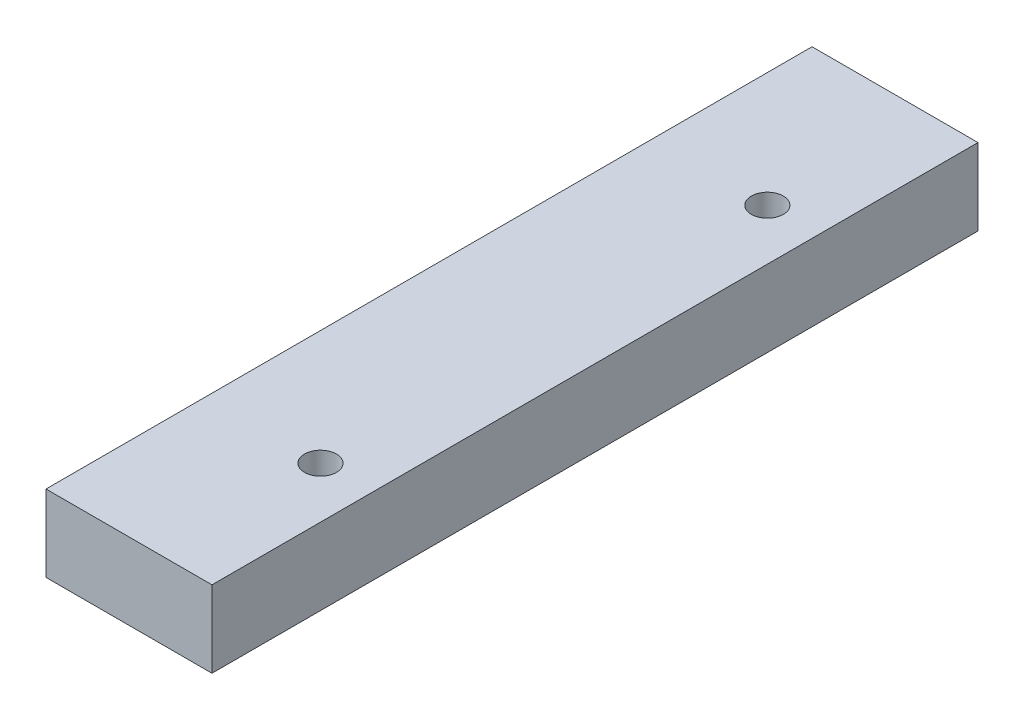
ISO-10303-21;
HEADER;
FILE_DESCRIPTION(('STEP AP214'),'2;1');
FILE_NAME('part.step','',(''),(''),'','','');
FILE_SCHEMA(('AUTOMOTIVE_DESIGN { 1 0 10303 214 1 1 1 1 }'));
ENDSEC;
DATA;
#1=APPLICATION_CONTEXT('core data for automotive mechanical design processes');
#2=APPLICATION_PROTOCOL_DEFINITION('international standard','automotive_design',2000,#1);
#3=PRODUCT_CONTEXT('',#1,'mechanical');
#4=PRODUCT('Part','Part','',(#3));
#5=PRODUCT_RELATED_PRODUCT_CATEGORY('part','',(#4));
#6=PRODUCT_DEFINITION_FORMATION('','',#4);
#7=PRODUCT_DEFINITION_CONTEXT('part definition',#1,'design');
#8=PRODUCT_DEFINITION('design','',#6,#7);
#9=PRODUCT_DEFINITION_SHAPE('','',#8);
#10=(LENGTH_UNIT() NAMED_UNIT(*) SI_UNIT(.MILLI.,.METRE.));
#11=(NAMED_UNIT(*) PLANE_ANGLE_UNIT() SI_UNIT($,.RADIAN.));
#12=(NAMED_UNIT(*) SI_UNIT($,.STERADIAN.) SOLID_ANGLE_UNIT());
#13=UNCERTAINTY_MEASURE_WITH_UNIT(LENGTH_MEASURE(1.E-05),#10,'distance_accuracy_value','');
#14=(GEOMETRIC_REPRESENTATION_CONTEXT(3) GLOBAL_UNCERTAINTY_ASSIGNED_CONTEXT((#13)) GLOBAL_UNIT_ASSIGNED_CONTEXT((#10,
#11,#12)) REPRESENTATION_CONTEXT('',''));
#15=CARTESIAN_POINT('',(0.,0.,0.));
#16=DIRECTION('',(0.,0.,1.));
#17=DIRECTION('',(1.,0.,0.));
#18=AXIS2_PLACEMENT_3D('',#15,#16,#17);
#19=CARTESIAN_POINT('',(0.,0.,60.));
#20=DIRECTION('',(1.,0.,0.));
#21=DIRECTION('',(0.,0.,-1.));
#22=AXIS2_PLACEMENT_3D('',#19,#20,#21);
#23=PLANE('',#22);
#24=DIRECTION('',(0.,-1.,0.));
#25=VECTOR('',#24,1.);
#26=CARTESIAN_POINT('',(0.,0.,-60.));
#27=LINE('',#26,#25);
#28=CARTESIAN_POINT('',(0.,12.,-60.));
#29=VERTEX_POINT('',#28);
#30=CARTESIAN_POINT('',(0.,0.,-60.));
#31=VERTEX_POINT('',#30);
#32=EDGE_CURVE('E392',#29,#31,#27,.T.);
#33=ORIENTED_EDGE('',*,*,#32,.T.);
#34=DIRECTION('',(0.,0.,-1.));
#35=VECTOR('',#34,1.);
#36=CARTESIAN_POINT('',(0.,0.,60.));
#37=LINE('',#36,#35);
#38=CARTESIAN_POINT('',(0.,0.,60.));
#39=VERTEX_POINT('',#38);
#40=EDGE_CURVE('E11',#39,#31,#37,.T.);
#41=ORIENTED_EDGE('',*,*,#40,.F.);
#42=DIRECTION('',(0.,-1.,0.));
#43=VECTOR('',#42,1.);
#44=CARTESIAN_POINT('',(0.,0.,60.));
#45=LINE('',#44,#43);
#46=CARTESIAN_POINT('',(0.,12.,60.));
#47=VERTEX_POINT('',#46);
#48=EDGE_CURVE('E415',#47,#39,#45,.T.);
#49=ORIENTED_EDGE('',*,*,#48,.F.);
#50=DIRECTION('',(0.,0.,-1.));
#51=VECTOR('',#50,1.);
#52=CARTESIAN_POINT('',(0.,12.,60.));
#53=LINE('',#52,#51);
#54=EDGE_CURVE('E404',#47,#29,#53,.T.);
#55=ORIENTED_EDGE('',*,*,#54,.T.);
#56=EDGE_LOOP('',(#33,#41,#49,#55));
#57=FACE_BOUND('',#56,.T.);
#58=ADVANCED_FACE('F348',(#57),#23,.F.);
#59=CARTESIAN_POINT('',(0.,0.,60.));
#60=DIRECTION('',(0.,1.,0.));
#61=DIRECTION('',(0.,0.,1.));
#62=AXIS2_PLACEMENT_3D('',#59,#60,#61);
#63=PLANE('',#62);
#64=CARTESIAN_POINT('',(18.,0.,-35.));
#65=DIRECTION('',(0.,-1.,0.));
#66=DIRECTION('',(0.,0.,-1.));
#67=AXIS2_PLACEMENT_3D('',#64,#65,#66);
#68=CIRCLE('',#67,2.5);
#69=CARTESIAN_POINT('',(18.,0.,-37.5));
#70=VERTEX_POINT('',#69);
#71=EDGE_CURVE('E450',#70,#70,#68,.T.);
#72=ORIENTED_EDGE('',*,*,#71,.F.);
#73=EDGE_LOOP('',(#72));
#74=FACE_BOUND('',#73,.T.);
#75=CARTESIAN_POINT('',(18.,0.,35.));
#76=DIRECTION('',(0.,-1.,0.));
#77=DIRECTION('',(0.,0.,-1.));
#78=AXIS2_PLACEMENT_3D('',#75,#76,#77);
#79=CIRCLE('',#78,2.5);
#80=CARTESIAN_POINT('',(18.,0.,32.5));
#81=VERTEX_POINT('',#80);
#82=EDGE_CURVE('E405',#81,#81,#79,.T.);
#83=ORIENTED_EDGE('',*,*,#82,.F.);
#84=EDGE_LOOP('',(#83));
#85=FACE_BOUND('',#84,.T.);
#86=DIRECTION('',(1.,0.,0.));
#87=VECTOR('',#86,1.);
#88=CARTESIAN_POINT('',(0.,0.,-60.));
#89=LINE('',#88,#87);
#90=CARTESIAN_POINT('',(26.,0.,-60.));
#91=VERTEX_POINT('',#90);
#92=EDGE_CURVE('E388',#31,#91,#89,.T.);
#93=ORIENTED_EDGE('',*,*,#92,.T.);
#94=DIRECTION('',(0.,0.,-1.));
#95=VECTOR('',#94,1.);
#96=CARTESIAN_POINT('',(26.,0.,60.));
#97=LINE('',#96,#95);
#98=CARTESIAN_POINT('',(26.,0.,60.));
#99=VERTEX_POINT('',#98);
#100=EDGE_CURVE('E355',#99,#91,#97,.T.);
#101=ORIENTED_EDGE('',*,*,#100,.F.);
#102=DIRECTION('',(1.,0.,0.));
#103=VECTOR('',#102,1.);
#104=CARTESIAN_POINT('',(0.,0.,60.));
#105=LINE('',#104,#103);
#106=EDGE_CURVE('E400',#39,#99,#105,.T.);
#107=ORIENTED_EDGE('',*,*,#106,.F.);
#108=ORIENTED_EDGE('',*,*,#40,.T.);
#109=EDGE_LOOP('',(#93,#101,#107,#108));
#110=FACE_BOUND('',#109,.T.);
#111=ADVANCED_FACE('F399',(#74,#85,#110),#63,.F.);
#112=CARTESIAN_POINT('',(26.,0.,60.));
#113=DIRECTION('',(-1.,0.,0.));
#114=DIRECTION('',(0.,0.,1.));
#115=AXIS2_PLACEMENT_3D('',#112,#113,#114);
#116=PLANE('',#115);
#117=DIRECTION('',(0.,1.,0.));
#118=VECTOR('',#117,1.);
#119=CARTESIAN_POINT('',(26.,0.,-60.));
#120=LINE('',#119,#118);
#121=CARTESIAN_POINT('',(26.,12.,-60.));
#122=VERTEX_POINT('',#121);
#123=EDGE_CURVE('E393',#91,#122,#120,.T.);
#124=ORIENTED_EDGE('',*,*,#123,.T.);
#125=DIRECTION('',(0.,0.,-1.));
#126=VECTOR('',#125,1.);
#127=CARTESIAN_POINT('',(26.,12.,60.));
#128=LINE('',#127,#126);
#129=CARTESIAN_POINT('',(26.,12.,60.));
#130=VERTEX_POINT('',#129);
#131=EDGE_CURVE('E421',#130,#122,#128,.T.);
#132=ORIENTED_EDGE('',*,*,#131,.F.);
#133=DIRECTION('',(0.,1.,0.));
#134=VECTOR('',#133,1.);
#135=CARTESIAN_POINT('',(26.,0.,60.));
#136=LINE('',#135,#134);
#137=EDGE_CURVE('E367',#99,#130,#136,.T.);
#138=ORIENTED_EDGE('',*,*,#137,.F.);
#139=ORIENTED_EDGE('',*,*,#100,.T.);
#140=EDGE_LOOP('',(#124,#132,#138,#139));
#141=FACE_BOUND('',#140,.T.);
#142=ADVANCED_FACE('F424',(#141),#116,.F.);
#143=CARTESIAN_POINT('',(0.,12.,60.));
#144=DIRECTION('',(0.,-1.,0.));
#145=DIRECTION('',(0.,0.,-1.));
#146=AXIS2_PLACEMENT_3D('',#143,#144,#145);
#147=PLANE('',#146);
#148=CARTESIAN_POINT('',(18.,12.,-35.));
#149=DIRECTION('',(0.,-1.,0.));
#150=DIRECTION('',(0.,0.,-1.));
#151=AXIS2_PLACEMENT_3D('',#148,#149,#150);
#152=CIRCLE('',#151,2.5);
#153=CARTESIAN_POINT('',(18.,12.,-37.5));
#154=VERTEX_POINT('',#153);
#155=EDGE_CURVE('E465',#154,#154,#152,.T.);
#156=ORIENTED_EDGE('',*,*,#155,.T.);
#157=EDGE_LOOP('',(#156));
#158=FACE_BOUND('',#157,.T.);
#159=CARTESIAN_POINT('',(18.,12.,35.));
#160=DIRECTION('',(0.,-1.,0.));
#161=DIRECTION('',(0.,0.,-1.));
#162=AXIS2_PLACEMENT_3D('',#159,#160,#161);
#163=CIRCLE('',#162,2.5);
#164=CARTESIAN_POINT('',(18.,12.,32.5));
#165=VERTEX_POINT('',#164);
#166=EDGE_CURVE('E408',#165,#165,#163,.T.);
#167=ORIENTED_EDGE('',*,*,#166,.T.);
#168=EDGE_LOOP('',(#167));
#169=FACE_BOUND('',#168,.T.);
#170=DIRECTION('',(-1.,0.,0.));
#171=VECTOR('',#170,1.);
#172=CARTESIAN_POINT('',(0.,12.,-60.));
#173=LINE('',#172,#171);
#174=EDGE_CURVE('E413',#122,#29,#173,.T.);
#175=ORIENTED_EDGE('',*,*,#174,.T.);
#176=ORIENTED_EDGE('',*,*,#54,.F.);
#177=DIRECTION('',(-1.,0.,0.));
#178=VECTOR('',#177,1.);
#179=CARTESIAN_POINT('',(0.,12.,60.));
#180=LINE('',#179,#178);
#181=EDGE_CURVE('E362',#130,#47,#180,.T.);
#182=ORIENTED_EDGE('',*,*,#181,.F.);
#183=ORIENTED_EDGE('',*,*,#131,.T.);
#184=EDGE_LOOP('',(#175,#176,#182,#183));
#185=FACE_BOUND('',#184,.T.);
#186=ADVANCED_FACE('F426',(#158,#169,#185),#147,.F.);
#187=CARTESIAN_POINT('',(0.,12.,60.));
#188=DIRECTION('',(0.,0.,-1.));
#189=DIRECTION('',(-1.,0.,0.));
#190=AXIS2_PLACEMENT_3D('',#187,#188,#189);
#191=PLANE('',#190);
#192=ORIENTED_EDGE('',*,*,#48,.T.);
#193=ORIENTED_EDGE('',*,*,#106,.T.);
#194=ORIENTED_EDGE('',*,*,#137,.T.);
#195=ORIENTED_EDGE('',*,*,#181,.T.);
#196=EDGE_LOOP('',(#192,#193,#194,#195));
#197=FACE_BOUND('',#196,.T.);
#198=ADVANCED_FACE('F427',(#197),#191,.F.);
#199=CARTESIAN_POINT('',(0.,12.,-60.));
#200=DIRECTION('',(0.,0.,-1.));
#201=DIRECTION('',(-1.,0.,0.));
#202=AXIS2_PLACEMENT_3D('',#199,#200,#201);
#203=PLANE('',#202);
#204=ORIENTED_EDGE('',*,*,#32,.F.);
#205=ORIENTED_EDGE('',*,*,#174,.F.);
#206=ORIENTED_EDGE('',*,*,#123,.F.);
#207=ORIENTED_EDGE('',*,*,#92,.F.);
#208=EDGE_LOOP('',(#204,#205,#206,#207));
#209=FACE_BOUND('',#208,.T.);
#210=ADVANCED_FACE('F389',(#209),#203,.T.);
#211=CARTESIAN_POINT('',(18.,0.,35.));
#212=DIRECTION('',(0.,-1.,0.));
#213=DIRECTION('',(0.,0.,-1.));
#214=AXIS2_PLACEMENT_3D('',#211,#212,#213);
#215=CYLINDRICAL_SURFACE('',#214,2.5);
#216=ORIENTED_EDGE('',*,*,#166,.F.);
#217=EDGE_LOOP('',(#216));
#218=FACE_BOUND('',#217,.T.);
#219=ORIENTED_EDGE('',*,*,#82,.T.);
#220=EDGE_LOOP('',(#219));
#221=FACE_BOUND('',#220,.T.);
#222=ADVANCED_FACE('F434',(#218,#221),#215,.F.);
#223=CARTESIAN_POINT('',(18.,0.,-35.));
#224=DIRECTION('',(0.,-1.,0.));
#225=DIRECTION('',(0.,0.,-1.));
#226=AXIS2_PLACEMENT_3D('',#223,#224,#225);
#227=CYLINDRICAL_SURFACE('',#226,2.5);
#228=ORIENTED_EDGE('',*,*,#155,.F.);
#229=EDGE_LOOP('',(#228));
#230=FACE_BOUND('',#229,.T.);
#231=ORIENTED_EDGE('',*,*,#71,.T.);
#232=EDGE_LOOP('',(#231));
#233=FACE_BOUND('',#232,.T.);
#234=ADVANCED_FACE('F454',(#230,#233),#227,.F.);
#235=CLOSED_SHELL('',(#58,#111,#142,#186,#198,#210,#222,#234));
#236=MANIFOLD_SOLID_BREP('B2',#235);
#237=ADVANCED_BREP_SHAPE_REPRESENTATION('',(#18,#236),#14);
#238=SHAPE_DEFINITION_REPRESENTATION(#9,#237);
ENDSEC;
END-ISO-10303-21;
